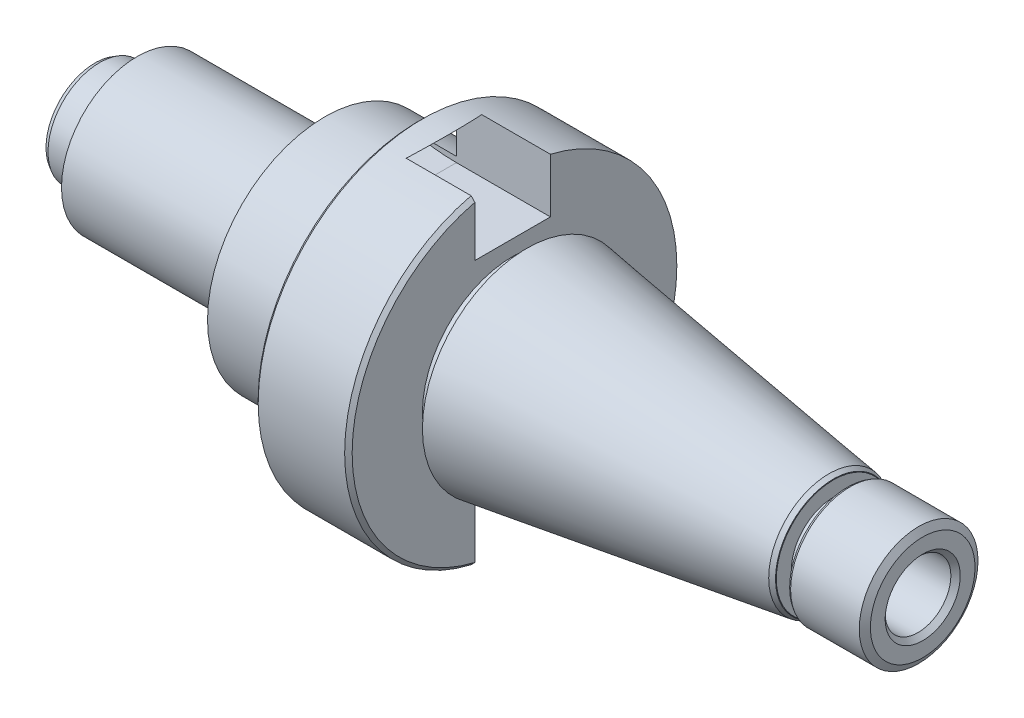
from build123d import *

# Parameters (mm, degrees)
CHANFREIN1_SIZE              = 0.866025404
CHANFREIN1_SIZE2             = 1.5
CHANFREIN2_SIZE              = 0.5
CHANFREIN2_SIZE2             = 0.288675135
CHANFREIN3_SIZE              = 0.5
CHANFREIN3_SIZE2             = 0.31851819
CHANFREIN5_SIZE              = 1
CHANFREIN5_SIZE2             = 0.577350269
ENL_V_MAT_EXTRU_1_DEPTH      = 8.05
R_P_TITION_CIRCULAIRE1_COUNT = 2
CHANFREIN6_SIZE              = 0.5
CHANFREIN6_SIZE2             = 0.67584205
CHANFREIN7_SIZE              = 0.8
CHANFREIN8_SIZE              = 1


with BuildPart() as part:
    # Esquisse1 → Base-R_volution (revolve)
    with BuildSketch(Plane.XY, mode=Mode.PRIVATE) as base_r_volution_sk:
        Polygon((-59.024185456, 11), (-50.024185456, 11), (-50.024185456, 16.119527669), (-10.024185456, 16.119527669), (-10.024185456, 25), (9.975814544, 25), (9.975814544, 35), (30, 35), (30, 19.225), (33, 19.225), (33, 22.225), (98.4, 12.695828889), (98.4, 9), (101.4, 9), (101.4, 12.65), (117.4, 12.65), (117.4, 7), (59.041451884, 7), (55, 0), (24.175426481, 0), (20.975814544, 5.541890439), (-59.024185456, 5.541890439), align=None)
    revolve(base_r_volution_sk.sketch.rotate(Axis((-30, 0, 0), (1, 0, 0)), 90), axis=Axis((-30, 0, 0), (1, 0, 0)))

    # Chanfrein1
    chanfrein1_edges = [part.edges().sort_by_distance(p)[0] for p in [
        (117.4, 0, -12.65),
    ]]
    chanfrein1_side = [part.faces().sort_by_distance(p)[0] for p in [
        (109.4, 0, -12.65),
    ]]
    chamfer(chanfrein1_edges, length=CHANFREIN1_SIZE, length2=CHANFREIN1_SIZE2, reference=chanfrein1_side[0])

    # Chanfrein2
    chanfrein2_edges = [part.edges().sort_by_distance(p)[0] for p in [
        (101.4, 0, -12.65),
    ]]
    chanfrein2_side = [part.faces().sort_by_distance(p)[0] for p in [
        (108.966987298, 0, -12.65),
    ]]
    chamfer(chanfrein2_edges, length=CHANFREIN2_SIZE, length2=CHANFREIN2_SIZE2, reference=chanfrein2_side[0])

    # Chanfrein3
    chanfrein3_edges = [part.edges().sort_by_distance(p)[0] for p in [
        (98.4, 0, -12.695828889),
    ]]
    chanfrein3_side = [part.faces().sort_by_distance(p)[0] for p in [
        (98.4, 0, -12.336736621),
    ]]
    chamfer(chanfrein3_edges, length=CHANFREIN3_SIZE, length2=CHANFREIN3_SIZE2, reference=chanfrein3_side[0])

    # Chanfrein5
    chanfrein5_edges = [part.edges().sort_by_distance(p)[0] for p in [
        (-59.024185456, 0, -11),
    ]]
    chanfrein5_side = [part.faces().sort_by_distance(p)[0] for p in [
        (-54.524185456, 0, -11),
    ]]
    chamfer(chanfrein5_edges, length=CHANFREIN5_SIZE, length2=CHANFREIN5_SIZE2, reference=chanfrein5_side[0])

    # Esquisse2 → Enl_v. mat.-Extru.1 (cut, symmetric)
    with BuildSketch(Plane.XY):
        with BuildLine():
            Line((9.975814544, 22.5), (37, 22.5))
            Line((37, 22.5), (37, 38))
            Line((37, 38), (20, 38))
            Line((20, 38), (2.586469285, 23.188454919))
            ThreePointArc((2.586469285, 23.188454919), (6.265140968, 22.672485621), (9.975814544, 22.5))
        make_face()
    enl_v_mat_extru_1 = extrude(amount=ENL_V_MAT_EXTRU_1_DEPTH, both=True, mode=Mode.SUBTRACT)

    # R_p_tition circulaire1: Enl_v. mat.-Extru.1 ×2 about axis
    r_p_tition_circulaire1_axis = Axis((0, 0, 0), (1, 0, 0))
    for i in range(1, R_P_TITION_CIRCULAIRE1_COUNT):
        add(enl_v_mat_extru_1.rotate(r_p_tition_circulaire1_axis, i * 360 / R_P_TITION_CIRCULAIRE1_COUNT), mode=Mode.SUBTRACT)

    # Chanfrein6
    chanfrein6_edges = [part.edges().sort_by_distance(p)[0] for p in [
        (98.084810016, 0, -12.741753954),
    ]]
    chanfrein6_side = [part.faces().sort_by_distance(p)[0] for p in [
        (98.242405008, 0, -12.468791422),
    ]]
    chamfer(chanfrein6_edges, length=CHANFREIN6_SIZE, length2=CHANFREIN6_SIZE2, reference=chanfrein6_side[0])

    # Chanfrein7
    chanfrein7_edges = [part.edges().sort_by_distance(p)[0] for p in [
        (9.975814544, 0, -35),
        (30, 21.71692888, 27.447677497),
    ]]
    chamfer(chanfrein7_edges, length=CHANFREIN7_SIZE)

    # Chanfrein8
    chanfrein8_edges = [part.edges().sort_by_distance(p)[0] for p in [
        (117.4, 0, -7),
    ]]
    chamfer(chanfrein8_edges, length=CHANFREIN8_SIZE)


solid = part.part
